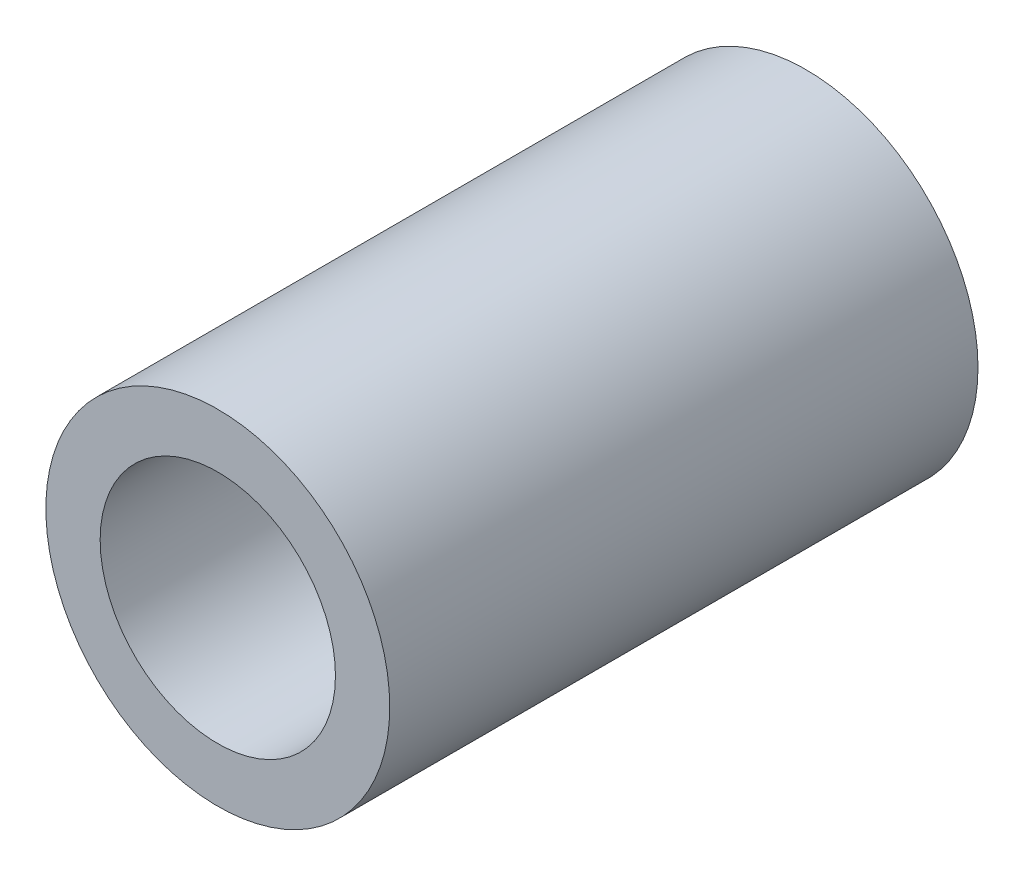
ISO-10303-21;
HEADER;
FILE_DESCRIPTION(('STEP AP214'),'2;1');
FILE_NAME('part.step','',(''),(''),'','','');
FILE_SCHEMA(('AUTOMOTIVE_DESIGN { 1 0 10303 214 1 1 1 1 }'));
ENDSEC;
DATA;
#1=APPLICATION_CONTEXT('core data for automotive mechanical design processes');
#2=APPLICATION_PROTOCOL_DEFINITION('international standard','automotive_design',2000,#1);
#3=PRODUCT_CONTEXT('',#1,'mechanical');
#4=PRODUCT('Part','Part','',(#3));
#5=PRODUCT_RELATED_PRODUCT_CATEGORY('part','',(#4));
#6=PRODUCT_DEFINITION_FORMATION('','',#4);
#7=PRODUCT_DEFINITION_CONTEXT('part definition',#1,'design');
#8=PRODUCT_DEFINITION('design','',#6,#7);
#9=PRODUCT_DEFINITION_SHAPE('','',#8);
#10=(LENGTH_UNIT() NAMED_UNIT(*) SI_UNIT(.MILLI.,.METRE.));
#11=(NAMED_UNIT(*) PLANE_ANGLE_UNIT() SI_UNIT($,.RADIAN.));
#12=(NAMED_UNIT(*) SI_UNIT($,.STERADIAN.) SOLID_ANGLE_UNIT());
#13=UNCERTAINTY_MEASURE_WITH_UNIT(LENGTH_MEASURE(1.E-05),#10,'distance_accuracy_value','');
#14=(GEOMETRIC_REPRESENTATION_CONTEXT(3) GLOBAL_UNCERTAINTY_ASSIGNED_CONTEXT((#13)) GLOBAL_UNIT_ASSIGNED_CONTEXT((#10,
#11,#12)) REPRESENTATION_CONTEXT('',''));
#15=CARTESIAN_POINT('',(0.,0.,0.));
#16=DIRECTION('',(0.,0.,1.));
#17=DIRECTION('',(1.,0.,0.));
#18=AXIS2_PLACEMENT_3D('',#15,#16,#17);
#19=CARTESIAN_POINT('',(0.,0.,65.));
#20=DIRECTION('',(0.,0.,1.));
#21=DIRECTION('',(1.,0.,0.));
#22=AXIS2_PLACEMENT_3D('',#19,#20,#21);
#23=PLANE('',#22);
#24=CARTESIAN_POINT('',(0.,0.,65.));
#25=DIRECTION('',(0.,0.,1.));
#26=DIRECTION('',(1.,0.,0.));
#27=AXIS2_PLACEMENT_3D('',#24,#25,#26);
#28=CIRCLE('',#27,19.);
#29=CARTESIAN_POINT('',(19.,0.,65.));
#30=VERTEX_POINT('',#29);
#31=EDGE_CURVE('E44',#30,#30,#28,.T.);
#32=ORIENTED_EDGE('',*,*,#31,.T.);
#33=EDGE_LOOP('',(#32));
#34=FACE_BOUND('',#33,.T.);
#35=CARTESIAN_POINT('',(0.,0.,65.));
#36=DIRECTION('',(0.,0.,1.));
#37=DIRECTION('',(1.,0.,0.));
#38=AXIS2_PLACEMENT_3D('',#35,#36,#37);
#39=CIRCLE('',#38,13.);
#40=CARTESIAN_POINT('',(13.,0.,65.));
#41=VERTEX_POINT('',#40);
#42=EDGE_CURVE('E53',#41,#41,#39,.T.);
#43=ORIENTED_EDGE('',*,*,#42,.F.);
#44=EDGE_LOOP('',(#43));
#45=FACE_BOUND('',#44,.T.);
#46=ADVANCED_FACE('F33',(#34,#45),#23,.T.);
#47=CARTESIAN_POINT('',(0.,0.,0.));
#48=DIRECTION('',(0.,0.,1.));
#49=DIRECTION('',(1.,0.,0.));
#50=AXIS2_PLACEMENT_3D('',#47,#48,#49);
#51=PLANE('',#50);
#52=CARTESIAN_POINT('',(0.,0.,0.));
#53=DIRECTION('',(0.,0.,1.));
#54=DIRECTION('',(1.,0.,0.));
#55=AXIS2_PLACEMENT_3D('',#52,#53,#54);
#56=CIRCLE('',#55,19.);
#57=CARTESIAN_POINT('',(19.,0.,0.));
#58=VERTEX_POINT('',#57);
#59=EDGE_CURVE('E48',#58,#58,#56,.T.);
#60=ORIENTED_EDGE('',*,*,#59,.F.);
#61=EDGE_LOOP('',(#60));
#62=FACE_BOUND('',#61,.T.);
#63=CARTESIAN_POINT('',(0.,0.,0.));
#64=DIRECTION('',(0.,0.,1.));
#65=DIRECTION('',(1.,0.,0.));
#66=AXIS2_PLACEMENT_3D('',#63,#64,#65);
#67=CIRCLE('',#66,13.);
#68=CARTESIAN_POINT('',(13.,0.,0.));
#69=VERTEX_POINT('',#68);
#70=EDGE_CURVE('E56',#69,#69,#67,.T.);
#71=ORIENTED_EDGE('',*,*,#70,.T.);
#72=EDGE_LOOP('',(#71));
#73=FACE_BOUND('',#72,.T.);
#74=ADVANCED_FACE('F83',(#62,#73),#51,.F.);
#75=CARTESIAN_POINT('',(0.,0.,65.));
#76=DIRECTION('',(0.,0.,-1.));
#77=DIRECTION('',(-1.,0.,0.));
#78=AXIS2_PLACEMENT_3D('',#75,#76,#77);
#79=CYLINDRICAL_SURFACE('',#78,19.);
#80=CARTESIAN_POINT('',(0.,-19.,30.60135));
#81=CARTESIAN_POINT('',(-0.106363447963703,-18.9999987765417,30.6013546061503));
#82=CARTESIAN_POINT('',(-0.212797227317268,-18.999097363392,30.6103179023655));
#83=CARTESIAN_POINT('',(-0.422714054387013,-18.9955881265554,30.645938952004));
#84=CARTESIAN_POINT('',(-0.526193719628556,-18.9929784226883,30.6726162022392));
#85=CARTESIAN_POINT('',(-0.727132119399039,-18.9863471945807,30.7428808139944));
#86=CARTESIAN_POINT('',(-0.824594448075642,-18.9823265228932,30.7864579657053));
#87=CARTESIAN_POINT('',(-1.01080015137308,-18.9733229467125,30.8892655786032));
#88=CARTESIAN_POINT('',(-1.09954525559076,-18.9683402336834,30.9484929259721));
#89=CARTESIAN_POINT('',(-1.26613756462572,-18.9579507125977,31.0811481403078));
#90=CARTESIAN_POINT('',(-1.34394904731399,-18.9525426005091,31.1546207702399));
#91=CARTESIAN_POINT('',(-1.48615831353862,-18.9419225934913,31.3135854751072));
#92=CARTESIAN_POINT('',(-1.55055547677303,-18.9367107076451,31.3990781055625));
#93=CARTESIAN_POINT('',(-1.66423452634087,-18.9270599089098,31.5798794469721));
#94=CARTESIAN_POINT('',(-1.71348410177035,-18.922622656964,31.6752085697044));
#95=CARTESIAN_POINT('',(-1.79526364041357,-18.9150396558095,31.8728353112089));
#96=CARTESIAN_POINT('',(-1.82779401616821,-18.9118938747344,31.9751327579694));
#97=CARTESIAN_POINT('',(-1.87510587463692,-18.9072617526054,32.1834281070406));
#98=CARTESIAN_POINT('',(-1.88994658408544,-18.9057698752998,32.2894124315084));
#99=CARTESIAN_POINT('',(-1.90164091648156,-18.9045972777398,32.502377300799));
#100=CARTESIAN_POINT('',(-1.89849501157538,-18.9049165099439,32.6093578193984));
#101=CARTESIAN_POINT('',(-1.87435423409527,-18.9073250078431,32.8208700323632));
#102=CARTESIAN_POINT('',(-1.85342402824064,-18.9094078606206,32.9254091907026));
#103=CARTESIAN_POINT('',(-1.79440939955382,-18.915098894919,33.1294834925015));
#104=CARTESIAN_POINT('',(-1.75632474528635,-18.9187070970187,33.2290185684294));
#105=CARTESIAN_POINT('',(-1.66401091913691,-18.9270496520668,33.420463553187));
#106=CARTESIAN_POINT('',(-1.60975305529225,-18.9317860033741,33.5123595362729));
#107=CARTESIAN_POINT('',(-1.48665361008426,-18.9418494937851,33.6857653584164));
#108=CARTESIAN_POINT('',(-1.41781160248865,-18.9471766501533,33.767274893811));
#109=CARTESIAN_POINT('',(-1.26713685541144,-18.9578500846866,33.9179698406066));
#110=CARTESIAN_POINT('',(-1.1852482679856,-18.9631963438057,33.9870994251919));
#111=CARTESIAN_POINT('',(-1.01099880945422,-18.9732834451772,34.1106394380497));
#112=CARTESIAN_POINT('',(-0.918637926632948,-18.9780242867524,34.1650498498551));
#113=CARTESIAN_POINT('',(-0.726026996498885,-18.9863679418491,34.2576047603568));
#114=CARTESIAN_POINT('',(-0.625775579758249,-18.9899705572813,34.2957464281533));
#115=CARTESIAN_POINT('',(-0.420247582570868,-18.9956298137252,34.3546402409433));
#116=CARTESIAN_POINT('',(-0.314971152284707,-18.9976865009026,34.3753929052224));
#117=CARTESIAN_POINT('',(-0.10286500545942,-19.0000162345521,34.3988487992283));
#118=CARTESIAN_POINT('',(0.00395611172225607,-19.0002968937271,34.4016290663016));
#119=CARTESIAN_POINT('',(0.216543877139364,-18.9990633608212,34.389263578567));
#120=CARTESIAN_POINT('',(0.322310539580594,-18.9975491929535,34.3741180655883));
#121=CARTESIAN_POINT('',(0.529564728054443,-18.992901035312,34.3263948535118));
#122=CARTESIAN_POINT('',(0.63106064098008,-18.9897703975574,34.2938532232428));
#123=CARTESIAN_POINT('',(0.827152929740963,-18.9822405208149,34.2122985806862));
#124=CARTESIAN_POINT('',(0.92174915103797,-18.9778412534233,34.1632851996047));
#125=CARTESIAN_POINT('',(1.10170513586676,-18.9682472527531,34.0499873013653));
#126=CARTESIAN_POINT('',(1.18703289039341,-18.9630499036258,33.9856521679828));
#127=CARTESIAN_POINT('',(1.3457057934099,-18.952451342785,33.8436095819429));
#128=CARTESIAN_POINT('',(1.41905064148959,-18.9470501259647,33.7659017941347));
#129=CARTESIAN_POINT('',(1.55194320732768,-18.9366296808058,33.5989836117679));
#130=CARTESIAN_POINT('',(1.61144036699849,-18.9316118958,33.5097328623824));
#131=CARTESIAN_POINT('',(1.71460109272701,-18.9225483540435,33.322461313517));
#132=CARTESIAN_POINT('',(1.75826487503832,-18.9185025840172,33.2244406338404));
#133=CARTESIAN_POINT('',(1.82843474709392,-18.9118501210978,33.0225850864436));
#134=CARTESIAN_POINT('',(1.85497092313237,-18.9092409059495,32.9187607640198));
#135=CARTESIAN_POINT('',(1.89022993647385,-18.9057491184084,32.708102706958));
#136=CARTESIAN_POINT('',(1.89895328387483,-18.904866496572,32.6012690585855));
#137=CARTESIAN_POINT('',(1.89833194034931,-18.90492886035,32.3881274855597));
#138=CARTESIAN_POINT('',(1.88906667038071,-18.9058658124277,32.2818193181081));
#139=CARTESIAN_POINT('',(1.8528976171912,-18.9094446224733,32.0722777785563));
#140=CARTESIAN_POINT('',(1.82599381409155,-18.9120864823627,31.9690444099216));
#141=CARTESIAN_POINT('',(1.75533329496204,-18.9187752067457,31.7685834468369));
#142=CARTESIAN_POINT('',(1.71157890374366,-18.9228218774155,31.6713550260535));
#143=CARTESIAN_POINT('',(1.60846744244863,-18.9318646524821,31.4856095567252));
#144=CARTESIAN_POINT('',(1.54911046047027,-18.9368607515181,31.3970924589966));
#145=CARTESIAN_POINT('',(1.41618051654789,-18.9472658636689,31.2308753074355));
#146=CARTESIAN_POINT('',(1.34254838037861,-18.9526765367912,31.1532226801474));
#147=CARTESIAN_POINT('',(1.18327526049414,-18.9632859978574,31.0113404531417));
#148=CARTESIAN_POINT('',(1.0976314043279,-18.9684847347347,30.947114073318));
#149=CARTESIAN_POINT('',(0.916530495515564,-18.9780981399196,30.8337805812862));
#150=CARTESIAN_POINT('',(0.821049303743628,-18.9825108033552,30.7847119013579));
#151=CARTESIAN_POINT('',(0.623219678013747,-18.9900330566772,30.7033691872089));
#152=CARTESIAN_POINT('',(0.520879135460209,-18.9931441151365,30.6710762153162));
#153=CARTESIAN_POINT('',(0.348299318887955,-18.9969308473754,30.6322546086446));
#154=CARTESIAN_POINT('',(0.279163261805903,-18.9980764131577,30.6206812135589));
#155=CARTESIAN_POINT('',(0.140028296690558,-18.9996113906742,30.6052274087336));
#156=CARTESIAN_POINT('',(0.0700293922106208,-19.0000008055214,30.6013469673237));
#157=CARTESIAN_POINT('',(0.,-19.,30.60135));
#158=B_SPLINE_CURVE_WITH_KNOTS('',3,(#80,#81,#82,#83,#84,#85,#86,#87,#88,#89,#90,#91,#92,#93,
#94,#95,#96,#97,#98,#99,#100,#101,#102,#103,#104,#105,#106,#107,#108,#109,#110,#111,#112,#113,
#114,#115,#116,#117,#118,#119,#120,#121,#122,#123,#124,#125,#126,#127,#128,#129,#130,#131,#132,
#133,#134,#135,#136,#137,#138,#139,#140,#141,#142,#143,#144,#145,#146,#147,#148,#149,#150,#151,
#152,#153,#154,#155,#156,#157),.UNSPECIFIED.,.T.,.F.,(4,2,2,2,2,2,2,2,2,2,2,2,2,2,2,2,2,2,2,2,2,
2,2,2,2,2,2,2,2,2,2,2,2,2,2,2,2,2,4),(0.,0.31883462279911,0.638020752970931,0.957014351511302,
1.27594452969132,1.59589361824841,1.91585749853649,2.23649922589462,2.55713304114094,
2.87669030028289,3.1962391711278,3.51463105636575,3.83302723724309,4.15199166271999,
4.47096541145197,4.79134319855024,5.11172134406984,5.43215521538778,5.75257951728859,
6.07162942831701,6.39067503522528,6.70906168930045,7.02745547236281,7.34691604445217,
7.6663846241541,7.98700190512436,8.30761480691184,8.62766297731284,8.94770198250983,
9.26633120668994,9.58496078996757,9.90354642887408,10.2221302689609,10.5420641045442,
10.862074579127,11.1828899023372,11.5033422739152,11.7132629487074,11.9231827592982),.UNSPECIFIED.);
#159=CARTESIAN_POINT('',(0.,-19.,30.60135));
#160=VERTEX_POINT('',#159);
#161=EDGE_CURVE('E10',#160,#160,#158,.T.);
#162=ORIENTED_EDGE('',*,*,#161,.T.);
#163=EDGE_LOOP('',(#162));
#164=FACE_BOUND('',#163,.T.);
#165=ORIENTED_EDGE('',*,*,#31,.F.);
#166=EDGE_LOOP('',(#165));
#167=FACE_BOUND('',#166,.T.);
#168=ORIENTED_EDGE('',*,*,#59,.T.);
#169=EDGE_LOOP('',(#168));
#170=FACE_BOUND('',#169,.T.);
#171=ADVANCED_FACE('F35',(#164,#167,#170),#79,.T.);
#172=CARTESIAN_POINT('',(0.,0.,65.));
#173=DIRECTION('',(0.,0.,-1.));
#174=DIRECTION('',(-1.,0.,0.));
#175=AXIS2_PLACEMENT_3D('',#172,#173,#174);
#176=CYLINDRICAL_SURFACE('',#175,13.);
#177=CARTESIAN_POINT('',(-0.134705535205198,-12.9993020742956,32.3096297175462));
#178=CARTESIAN_POINT('',(-0.145257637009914,-12.9991927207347,32.3173200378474));
#179=CARTESIAN_POINT('',(-0.15516440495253,-12.9990771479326,32.325912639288));
#180=CARTESIAN_POINT('',(-0.173405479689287,-12.9988466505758,32.3446445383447));
#181=CARTESIAN_POINT('',(-0.181737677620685,-12.9987317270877,32.3547858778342));
#182=CARTESIAN_POINT('',(-0.196599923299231,-12.9985154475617,32.3763186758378));
#183=CARTESIAN_POINT('',(-0.203129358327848,-12.9984140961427,32.3877105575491));
#184=CARTESIAN_POINT('',(-0.214210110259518,-12.9982362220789,32.4114145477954));
#185=CARTESIAN_POINT('',(-0.218761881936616,-12.9981596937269,32.4237264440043));
#186=CARTESIAN_POINT('',(-0.225821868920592,-12.9980389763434,32.4491022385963));
#187=CARTESIAN_POINT('',(-0.228301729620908,-12.9979952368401,32.4621740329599));
#188=CARTESIAN_POINT('',(-0.231049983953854,-12.9979466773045,32.4885490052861));
#189=CARTESIAN_POINT('',(-0.231318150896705,-12.9979418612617,32.5018522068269));
#190=CARTESIAN_POINT('',(-0.229629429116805,-12.9979718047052,32.5284152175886));
#191=CARTESIAN_POINT('',(-0.227656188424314,-12.9980068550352,32.5416739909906));
#192=CARTESIAN_POINT('',(-0.221509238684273,-12.9981130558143,32.5676715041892));
#193=CARTESIAN_POINT('',(-0.217335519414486,-12.9981842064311,32.5804102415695));
#194=CARTESIAN_POINT('',(-0.20690496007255,-12.9983544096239,32.6049833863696));
#195=CARTESIAN_POINT('',(-0.200651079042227,-12.9984534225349,32.6168190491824));
#196=CARTESIAN_POINT('',(-0.186226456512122,-12.9986680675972,32.6392585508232));
#197=CARTESIAN_POINT('',(-0.17805580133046,-12.998783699,32.6498624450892));
#198=CARTESIAN_POINT('',(-0.160111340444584,-12.9990170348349,32.6694229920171));
#199=CARTESIAN_POINT('',(-0.15035399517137,-12.9991347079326,32.6783947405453));
#200=CARTESIAN_POINT('',(-0.12945268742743,-12.9993596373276,32.6945442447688));
#201=CARTESIAN_POINT('',(-0.118308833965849,-12.9994668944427,32.701722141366));
#202=CARTESIAN_POINT('',(-0.0951209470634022,-12.999657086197,32.7139715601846));
#203=CARTESIAN_POINT('',(-0.0830919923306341,-12.9997403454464,32.7190716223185));
#204=CARTESIAN_POINT('',(-0.0583417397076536,-12.9998749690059,32.7271512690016));
#205=CARTESIAN_POINT('',(-0.0456204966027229,-12.9999263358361,32.7301310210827));
#206=CARTESIAN_POINT('',(-0.0200158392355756,-12.9999908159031,32.7338526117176));
#207=CARTESIAN_POINT('',(-0.00713637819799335,-13.0000043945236,32.7346216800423));
#208=CARTESIAN_POINT('',(0.0185673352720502,-12.9999930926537,32.7339757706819));
#209=CARTESIAN_POINT('',(0.0313915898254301,-12.9999682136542,32.7325608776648));
#210=CARTESIAN_POINT('',(0.05655946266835,-12.9998830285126,32.7276029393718));
#211=CARTESIAN_POINT('',(0.0689050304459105,-12.9998228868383,32.7240697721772));
#212=CARTESIAN_POINT('',(0.0928322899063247,-12.9996740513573,32.7149917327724));
#213=CARTESIAN_POINT('',(0.104413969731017,-12.9995853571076,32.7094468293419));
#214=CARTESIAN_POINT('',(0.126553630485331,-12.9993887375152,32.6964772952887));
#215=CARTESIAN_POINT('',(0.137105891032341,-12.9992807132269,32.6890429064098));
#216=CARTESIAN_POINT('',(0.156832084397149,-12.9990577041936,32.6725284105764));
#217=CARTESIAN_POINT('',(0.16600593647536,-12.9989427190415,32.6634482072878));
#218=CARTESIAN_POINT('',(0.182839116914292,-12.9987169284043,32.6437797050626));
#219=CARTESIAN_POINT('',(0.190478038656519,-12.9986061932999,32.6331739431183));
#220=CARTESIAN_POINT('',(0.203896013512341,-12.9984026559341,32.6108448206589));
#221=CARTESIAN_POINT('',(0.209674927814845,-12.9983098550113,32.5991213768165));
#222=CARTESIAN_POINT('',(0.21929236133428,-12.9981511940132,32.5747129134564));
#223=CARTESIAN_POINT('',(0.223102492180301,-12.998085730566,32.5620167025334));
#224=CARTESIAN_POINT('',(0.228560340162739,-12.9979909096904,32.5361674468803));
#225=CARTESIAN_POINT('',(0.230207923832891,-12.9979615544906,32.5230143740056));
#226=CARTESIAN_POINT('',(0.231303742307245,-12.9979421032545,32.4964891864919));
#227=CARTESIAN_POINT('',(0.230730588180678,-12.9979523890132,32.4831161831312));
#228=CARTESIAN_POINT('',(0.227351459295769,-12.9980119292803,32.4566550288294));
#229=CARTESIAN_POINT('',(0.224545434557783,-12.998061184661,32.4435668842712));
#230=CARTESIAN_POINT('',(0.216767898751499,-12.9981932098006,32.4180295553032));
#231=CARTESIAN_POINT('',(0.211793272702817,-12.9982760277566,32.4055813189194));
#232=CARTESIAN_POINT('',(0.19980976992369,-12.9984657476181,32.3817054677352));
#233=CARTESIAN_POINT('',(0.192800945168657,-12.9985726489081,32.3702778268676));
#234=CARTESIAN_POINT('',(0.176998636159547,-12.9987973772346,32.3488623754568));
#235=CARTESIAN_POINT('',(0.168218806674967,-12.9989151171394,32.3388644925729));
#236=CARTESIAN_POINT('',(0.149084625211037,-12.9991486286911,32.3205095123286));
#237=CARTESIAN_POINT('',(0.138730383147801,-12.9992644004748,32.3121523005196));
#238=CARTESIAN_POINT('',(0.116889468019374,-12.9994790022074,32.2974370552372));
#239=CARTESIAN_POINT('',(0.10541988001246,-12.9995780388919,32.2910536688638));
#240=CARTESIAN_POINT('',(0.0815612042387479,-12.999749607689,32.2803340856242));
#241=CARTESIAN_POINT('',(0.0691722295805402,-12.9998221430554,32.2759976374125));
#242=CARTESIAN_POINT('',(0.0440098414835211,-12.9999315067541,32.2695534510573));
#243=CARTESIAN_POINT('',(0.0312440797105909,-12.9999688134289,32.2674158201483));
#244=CARTESIAN_POINT('',(0.00553160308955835,-13.0000051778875,32.2653314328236));
#245=CARTESIAN_POINT('',(-0.00741514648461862,-13.0000042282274,32.2653851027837));
#246=CARTESIAN_POINT('',(-0.0330207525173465,-12.9999643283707,32.2676737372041));
#247=CARTESIAN_POINT('',(-0.0456809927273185,-12.9999256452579,32.2698933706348));
#248=CARTESIAN_POINT('',(-0.0704391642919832,-12.9998150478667,32.276421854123));
#249=CARTESIAN_POINT('',(-0.0825377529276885,-12.9997431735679,32.2807281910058));
#250=CARTESIAN_POINT('',(-0.101319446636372,-12.9996071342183,32.2892409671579));
#251=CARTESIAN_POINT('',(-0.108284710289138,-12.9995507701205,32.292839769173));
#252=CARTESIAN_POINT('',(-0.12181257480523,-12.9994310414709,32.3007273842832));
#253=CARTESIAN_POINT('',(-0.128375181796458,-12.9993676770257,32.3050161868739));
#254=CARTESIAN_POINT('',(-0.134705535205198,-12.9993020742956,32.3096297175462));
#255=B_SPLINE_CURVE_WITH_KNOTS('',3,(#177,#178,#179,#180,#181,#182,#183,#184,#185,#186,#187,
#188,#189,#190,#191,#192,#193,#194,#195,#196,#197,#198,#199,#200,#201,#202,#203,#204,#205,#206,
#207,#208,#209,#210,#211,#212,#213,#214,#215,#216,#217,#218,#219,#220,#221,#222,#223,#224,#225,
#226,#227,#228,#229,#230,#231,#232,#233,#234,#235,#236,#237,#238,#239,#240,#241,#242,#243,#244,
#245,#246,#247,#248,#249,#250,#251,#252,#253,#254),.UNSPECIFIED.,.T.,.F.,(4,2,2,2,2,2,2,2,2,2,2,
2,2,2,2,2,2,2,2,2,2,2,2,2,2,2,2,2,2,2,2,2,2,2,2,2,2,2,4),(0.,0.0391438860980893,
0.0783398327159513,0.117549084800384,0.156749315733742,0.196477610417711,0.236209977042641,
0.276234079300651,0.316258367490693,0.356225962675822,0.396191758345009,0.435766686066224,
0.475338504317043,0.514346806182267,0.553352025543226,0.591874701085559,0.630395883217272,
0.668738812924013,0.707082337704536,0.745628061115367,0.784176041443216,0.823206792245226,
0.862240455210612,0.901822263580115,0.941406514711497,0.98137296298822,1.02134030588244,
1.06136524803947,1.10138916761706,1.14111554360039,1.18083914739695,1.22002901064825,
1.25921406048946,1.29785905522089,1.33651156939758,1.37489246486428,1.41322724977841,
1.43671057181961,1.46019353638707),.UNSPECIFIED.);
#256=CARTESIAN_POINT('',(-0.134705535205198,-12.9993020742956,32.3096297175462));
#257=VERTEX_POINT('',#256);
#258=EDGE_CURVE('E58',#257,#257,#255,.T.);
#259=ORIENTED_EDGE('',*,*,#258,.F.);
#260=EDGE_LOOP('',(#259));
#261=FACE_BOUND('',#260,.T.);
#262=ORIENTED_EDGE('',*,*,#42,.T.);
#263=EDGE_LOOP('',(#262));
#264=FACE_BOUND('',#263,.T.);
#265=ORIENTED_EDGE('',*,*,#70,.F.);
#266=EDGE_LOOP('',(#265));
#267=FACE_BOUND('',#266,.T.);
#268=ADVANCED_FACE('F65',(#261,#264,#267),#176,.F.);
#269=CARTESIAN_POINT('',(0.,-19.,32.5));
#270=DIRECTION('',(0.,-1.,0.));
#271=DIRECTION('',(0.,0.,-1.));
#272=AXIS2_PLACEMENT_3D('',#269,#270,#271);
#273=CYLINDRICAL_SURFACE('',#272,1.89864999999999);
#274=CARTESIAN_POINT('',(0.,-14.,32.5));
#275=DIRECTION('',(0.,-1.,0.));
#276=DIRECTION('',(0.,0.,-1.));
#277=AXIS2_PLACEMENT_3D('',#274,#275,#276);
#278=CIRCLE('',#277,1.89865);
#279=CARTESIAN_POINT('',(0.,-14.,30.60135));
#280=VERTEX_POINT('',#279);
#281=EDGE_CURVE('E64',#280,#280,#278,.T.);
#282=ORIENTED_EDGE('',*,*,#281,.F.);
#283=EDGE_LOOP('',(#282));
#284=FACE_BOUND('',#283,.T.);
#285=ORIENTED_EDGE('',*,*,#161,.F.);
#286=EDGE_LOOP('',(#285));
#287=FACE_BOUND('',#286,.T.);
#288=ADVANCED_FACE('F71',(#284,#287),#273,.F.);
#289=CARTESIAN_POINT('',(0.,-14.,32.5));
#290=DIRECTION('',(0.,-1.,0.));
#291=DIRECTION('',(0.,0.,-1.));
#292=AXIS2_PLACEMENT_3D('',#289,#290,#291);
#293=CONICAL_SURFACE('',#292,1.89865,1.02974425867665);
#294=ORIENTED_EDGE('',*,*,#258,.T.);
#295=EDGE_LOOP('',(#294));
#296=FACE_BOUND('',#295,.T.);
#297=ORIENTED_EDGE('',*,*,#281,.T.);
#298=EDGE_LOOP('',(#297));
#299=FACE_BOUND('',#298,.T.);
#300=ADVANCED_FACE('F68',(#296,#299),#293,.F.);
#301=CLOSED_SHELL('',(#46,#74,#171,#268,#288,#300));
#302=MANIFOLD_SOLID_BREP('B2',#301);
#303=ADVANCED_BREP_SHAPE_REPRESENTATION('',(#18,#302),#14);
#304=SHAPE_DEFINITION_REPRESENTATION(#9,#303);
ENDSEC;
END-ISO-10303-21;
